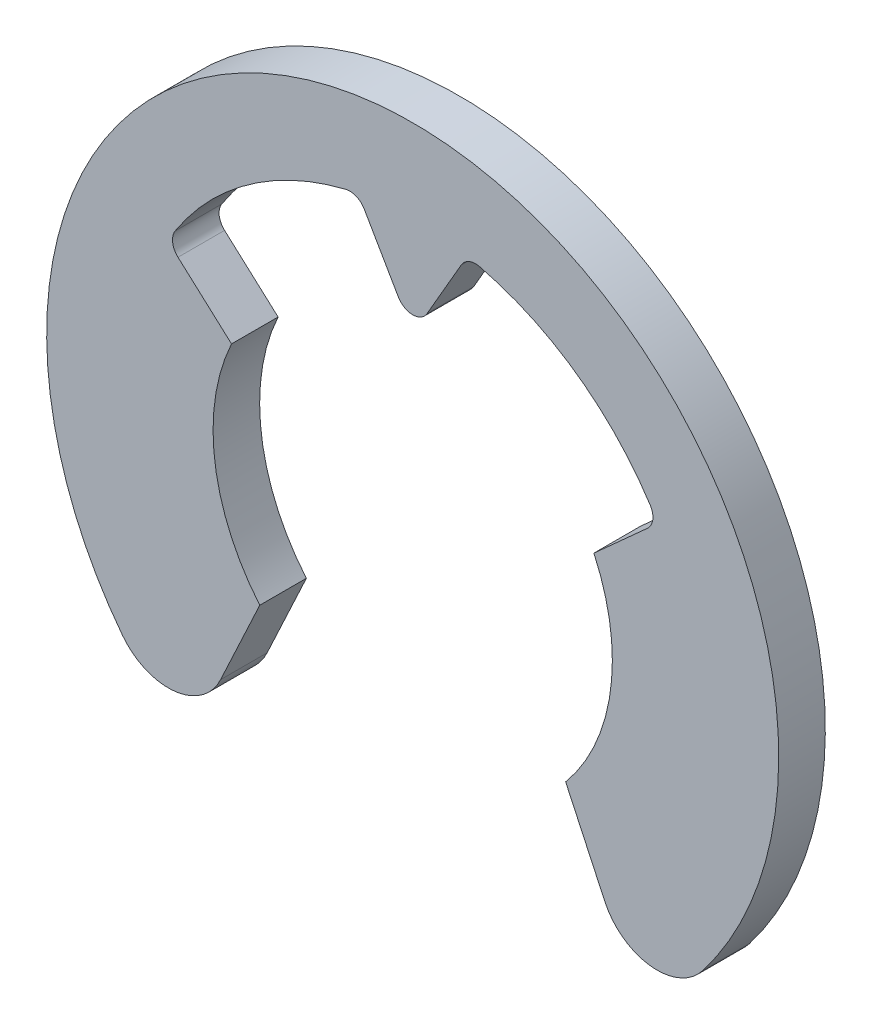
ISO-10303-21;
HEADER;
FILE_DESCRIPTION(('STEP AP214'),'2;1');
FILE_NAME('part.step','',(''),(''),'','','');
FILE_SCHEMA(('AUTOMOTIVE_DESIGN { 1 0 10303 214 1 1 1 1 }'));
ENDSEC;
DATA;
#1=APPLICATION_CONTEXT('core data for automotive mechanical design processes');
#2=APPLICATION_PROTOCOL_DEFINITION('international standard','automotive_design',2000,#1);
#3=PRODUCT_CONTEXT('',#1,'mechanical');
#4=PRODUCT('Part','Part','',(#3));
#5=PRODUCT_RELATED_PRODUCT_CATEGORY('part','',(#4));
#6=PRODUCT_DEFINITION_FORMATION('','',#4);
#7=PRODUCT_DEFINITION_CONTEXT('part definition',#1,'design');
#8=PRODUCT_DEFINITION('design','',#6,#7);
#9=PRODUCT_DEFINITION_SHAPE('','',#8);
#10=(LENGTH_UNIT() NAMED_UNIT(*) SI_UNIT(.MILLI.,.METRE.));
#11=(NAMED_UNIT(*) PLANE_ANGLE_UNIT() SI_UNIT($,.RADIAN.));
#12=(NAMED_UNIT(*) SI_UNIT($,.STERADIAN.) SOLID_ANGLE_UNIT());
#13=UNCERTAINTY_MEASURE_WITH_UNIT(LENGTH_MEASURE(1.E-05),#10,'distance_accuracy_value','');
#14=(GEOMETRIC_REPRESENTATION_CONTEXT(3) GLOBAL_UNCERTAINTY_ASSIGNED_CONTEXT((#13)) GLOBAL_UNIT_ASSIGNED_CONTEXT((#10,
#11,#12)) REPRESENTATION_CONTEXT('',''));
#15=CARTESIAN_POINT('',(0.,0.,0.));
#16=DIRECTION('',(0.,0.,1.));
#17=DIRECTION('',(1.,0.,0.));
#18=AXIS2_PLACEMENT_3D('',#15,#16,#17);
#19=CARTESIAN_POINT('',(0.94499048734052,3.88677153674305,0.));
#20=DIRECTION('',(0.,0.,1.));
#21=DIRECTION('',(1.,0.,0.));
#22=AXIS2_PLACEMENT_3D('',#19,#20,#21);
#23=PLANE('',#22);
#24=DIRECTION('',(0.500000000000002,0.866025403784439,0.));
#25=VECTOR('',#24,1.);
#26=CARTESIAN_POINT('',(0.21650635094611,3.125,0.));
#27=LINE('',#26,#25);
#28=CARTESIAN_POINT('',(0.21650635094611,3.125,0.));
#29=VERTEX_POINT('',#28);
#30=CARTESIAN_POINT('',(0.72848413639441,4.01177153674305,0.));
#31=VERTEX_POINT('',#30);
#32=EDGE_CURVE('E268',#29,#31,#27,.T.);
#33=ORIENTED_EDGE('',*,*,#32,.F.);
#34=CARTESIAN_POINT('',(0.,3.25,0.));
#35=DIRECTION('',(0.,0.,-1.));
#36=DIRECTION('',(-1.,0.,0.));
#37=AXIS2_PLACEMENT_3D('',#34,#35,#36);
#38=CIRCLE('',#37,0.250000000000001);
#39=CARTESIAN_POINT('',(-0.21650635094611,3.125,0.));
#40=VERTEX_POINT('',#39);
#41=EDGE_CURVE('E269',#40,#29,#38,.F.);
#42=ORIENTED_EDGE('',*,*,#41,.F.);
#43=DIRECTION('',(0.500000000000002,-0.866025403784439,0.));
#44=VECTOR('',#43,1.);
#45=CARTESIAN_POINT('',(-0.72848413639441,4.01177153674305,0.));
#46=LINE('',#45,#44);
#47=CARTESIAN_POINT('',(-0.72848413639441,4.01177153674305,0.));
#48=VERTEX_POINT('',#47);
#49=EDGE_CURVE('E145',#48,#40,#46,.T.);
#50=ORIENTED_EDGE('',*,*,#49,.F.);
#51=CARTESIAN_POINT('',(-0.94499048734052,3.88677153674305,0.));
#52=DIRECTION('',(0.,0.,-1.));
#53=DIRECTION('',(-1.,0.,0.));
#54=AXIS2_PLACEMENT_3D('',#51,#52,#53);
#55=CIRCLE('',#54,0.25);
#56=CARTESIAN_POINT('',(-1.0040523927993,4.12969475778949,0.));
#57=VERTEX_POINT('',#56);
#58=EDGE_CURVE('E20',#57,#48,#55,.T.);
#59=ORIENTED_EDGE('',*,*,#58,.F.);
#60=CARTESIAN_POINT('',(0.,0.,0.));
#61=DIRECTION('',(0.,0.,-1.));
#62=DIRECTION('',(-1.,0.,0.));
#63=AXIS2_PLACEMENT_3D('',#60,#61,#62);
#64=CIRCLE('',#63,4.25);
#65=CARTESIAN_POINT('',(-3.56964438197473,2.30654264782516,0.));
#66=VERTEX_POINT('',#65);
#67=EDGE_CURVE('E142',#57,#66,#64,.F.);
#68=ORIENTED_EDGE('',*,*,#67,.T.);
#69=CARTESIAN_POINT('',(-3.35966530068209,2.17086366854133,0.));
#70=DIRECTION('',(0.,0.,-1.));
#71=DIRECTION('',(-1.,0.,0.));
#72=AXIS2_PLACEMENT_3D('',#69,#70,#71);
#73=CIRCLE('',#72,0.25);
#74=CARTESIAN_POINT('',(-3.52705789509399,1.98517651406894,0.));
#75=VERTEX_POINT('',#74);
#76=EDGE_CURVE('E168',#66,#75,#73,.F.);
#77=ORIENTED_EDGE('',*,*,#76,.T.);
#78=DIRECTION('',(-0.742748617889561,0.669570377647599,0.));
#79=VECTOR('',#78,1.);
#80=CARTESIAN_POINT('',(-3.52705789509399,1.98517651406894,0.));
#81=LINE('',#80,#79);
#82=CARTESIAN_POINT('',(-2.72258807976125,1.25996593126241,0.));
#83=VERTEX_POINT('',#82);
#84=EDGE_CURVE('E174',#83,#75,#81,.T.);
#85=ORIENTED_EDGE('',*,*,#84,.F.);
#86=CARTESIAN_POINT('',(0.,0.,0.));
#87=DIRECTION('',(0.,0.,-1.));
#88=DIRECTION('',(-1.,0.,0.));
#89=AXIS2_PLACEMENT_3D('',#86,#87,#88);
#90=CIRCLE('',#89,3.);
#91=CARTESIAN_POINT('',(-2.29813332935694,-1.92836282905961,0.));
#92=VERTEX_POINT('',#91);
#93=EDGE_CURVE('E177',#83,#92,#90,.F.);
#94=ORIENTED_EDGE('',*,*,#93,.T.);
#95=DIRECTION('',(0.422618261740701,0.90630778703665,0.));
#96=VECTOR('',#95,1.);
#97=CARTESIAN_POINT('',(-2.29813332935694,-1.92836282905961,0.));
#98=LINE('',#97,#96);
#99=CARTESIAN_POINT('',(-2.88776694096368,-3.1928361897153,0.));
#100=VERTEX_POINT('',#99);
#101=EDGE_CURVE('E181',#100,#92,#98,.T.);
#102=ORIENTED_EDGE('',*,*,#101,.F.);
#103=CARTESIAN_POINT('',(-3.67227291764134,-2.82701504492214,0.));
#104=DIRECTION('',(0.,0.,-1.));
#105=DIRECTION('',(-1.,0.,0.));
#106=AXIS2_PLACEMENT_3D('',#103,#104,#105);
#107=CIRCLE('',#106,0.865606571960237);
#108=CARTESIAN_POINT('',(-4.35817574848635,-3.35504160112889,0.));
#109=VERTEX_POINT('',#108);
#110=EDGE_CURVE('E185',#109,#100,#107,.F.);
#111=ORIENTED_EDGE('',*,*,#110,.F.);
#112=CARTESIAN_POINT('',(0.,0.,0.));
#113=DIRECTION('',(0.,0.,-1.));
#114=DIRECTION('',(-1.,0.,0.));
#115=AXIS2_PLACEMENT_3D('',#112,#113,#114);
#116=CIRCLE('',#115,5.5);
#117=CARTESIAN_POINT('',(4.35817574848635,-3.35504160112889,0.));
#118=VERTEX_POINT('',#117);
#119=EDGE_CURVE('E189',#118,#109,#116,.F.);
#120=ORIENTED_EDGE('',*,*,#119,.F.);
#121=CARTESIAN_POINT('',(3.67227291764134,-2.82701504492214,0.));
#122=DIRECTION('',(0.,0.,-1.));
#123=DIRECTION('',(-1.,0.,0.));
#124=AXIS2_PLACEMENT_3D('',#121,#122,#123);
#125=CIRCLE('',#124,0.865606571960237);
#126=CARTESIAN_POINT('',(2.88776694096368,-3.1928361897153,0.));
#127=VERTEX_POINT('',#126);
#128=EDGE_CURVE('E193',#127,#118,#125,.F.);
#129=ORIENTED_EDGE('',*,*,#128,.F.);
#130=DIRECTION('',(-0.422618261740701,0.90630778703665,0.));
#131=VECTOR('',#130,1.);
#132=CARTESIAN_POINT('',(2.29813332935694,-1.92836282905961,0.));
#133=LINE('',#132,#131);
#134=CARTESIAN_POINT('',(2.29813332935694,-1.92836282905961,0.));
#135=VERTEX_POINT('',#134);
#136=EDGE_CURVE('E196',#127,#135,#133,.T.);
#137=ORIENTED_EDGE('',*,*,#136,.T.);
#138=CARTESIAN_POINT('',(0.,0.,0.));
#139=DIRECTION('',(0.,0.,-1.));
#140=DIRECTION('',(-1.,0.,0.));
#141=AXIS2_PLACEMENT_3D('',#138,#139,#140);
#142=CIRCLE('',#141,3.);
#143=CARTESIAN_POINT('',(2.72258807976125,1.25996593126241,0.));
#144=VERTEX_POINT('',#143);
#145=EDGE_CURVE('E197',#135,#144,#142,.F.);
#146=ORIENTED_EDGE('',*,*,#145,.T.);
#147=DIRECTION('',(0.742748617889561,0.669570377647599,0.));
#148=VECTOR('',#147,1.);
#149=CARTESIAN_POINT('',(3.52705789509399,1.98517651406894,0.));
#150=LINE('',#149,#148);
#151=CARTESIAN_POINT('',(3.52705789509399,1.98517651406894,0.));
#152=VERTEX_POINT('',#151);
#153=EDGE_CURVE('E200',#144,#152,#150,.T.);
#154=ORIENTED_EDGE('',*,*,#153,.T.);
#155=CARTESIAN_POINT('',(3.35966530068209,2.17086366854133,0.));
#156=DIRECTION('',(0.,0.,-1.));
#157=DIRECTION('',(-1.,0.,0.));
#158=AXIS2_PLACEMENT_3D('',#155,#156,#157);
#159=CIRCLE('',#158,0.25);
#160=CARTESIAN_POINT('',(3.56964438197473,2.30654264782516,0.));
#161=VERTEX_POINT('',#160);
#162=EDGE_CURVE('E203',#152,#161,#159,.F.);
#163=ORIENTED_EDGE('',*,*,#162,.T.);
#164=CARTESIAN_POINT('',(0.,0.,0.));
#165=DIRECTION('',(0.,0.,-1.));
#166=DIRECTION('',(-1.,0.,0.));
#167=AXIS2_PLACEMENT_3D('',#164,#165,#166);
#168=CIRCLE('',#167,4.25);
#169=CARTESIAN_POINT('',(1.0040523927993,4.12969475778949,0.));
#170=VERTEX_POINT('',#169);
#171=EDGE_CURVE('E206',#161,#170,#168,.F.);
#172=ORIENTED_EDGE('',*,*,#171,.T.);
#173=CARTESIAN_POINT('',(0.94499048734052,3.88677153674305,0.));
#174=DIRECTION('',(0.,0.,-1.));
#175=DIRECTION('',(-1.,0.,0.));
#176=AXIS2_PLACEMENT_3D('',#173,#174,#175);
#177=CIRCLE('',#176,0.25);
#178=EDGE_CURVE('E209',#170,#31,#177,.F.);
#179=ORIENTED_EDGE('',*,*,#178,.T.);
#180=EDGE_LOOP('',(#33,#42,#50,#59,#68,#77,#85,#94,#102,#111,#120,#129,#137,#146,#154,#163,#172,#179));
#181=FACE_BOUND('',#180,.T.);
#182=ADVANCED_FACE('F16',(#181),#23,.F.);
#183=CARTESIAN_POINT('',(0.94499048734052,3.88677153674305,0.700000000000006));
#184=DIRECTION('',(0.,0.,-1.));
#185=DIRECTION('',(-1.,0.,0.));
#186=AXIS2_PLACEMENT_3D('',#183,#184,#185);
#187=CYLINDRICAL_SURFACE('',#186,0.25);
#188=DIRECTION('',(0.,0.,-1.));
#189=VECTOR('',#188,1.);
#190=CARTESIAN_POINT('',(1.0040523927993,4.12969475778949,0.700000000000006));
#191=LINE('',#190,#189);
#192=CARTESIAN_POINT('',(1.0040523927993,4.12969475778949,0.700000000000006));
#193=VERTEX_POINT('',#192);
#194=EDGE_CURVE('E207',#170,#193,#191,.F.);
#195=ORIENTED_EDGE('',*,*,#194,.T.);
#196=CARTESIAN_POINT('',(0.94499048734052,3.88677153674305,0.700000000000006));
#197=DIRECTION('',(0.,0.,-1.));
#198=DIRECTION('',(-1.,0.,0.));
#199=AXIS2_PLACEMENT_3D('',#196,#197,#198);
#200=CIRCLE('',#199,0.25);
#201=CARTESIAN_POINT('',(0.72848413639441,4.01177153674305,0.700000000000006));
#202=VERTEX_POINT('',#201);
#203=EDGE_CURVE('E249',#202,#193,#200,.T.);
#204=ORIENTED_EDGE('',*,*,#203,.F.);
#205=DIRECTION('',(0.,0.,1.));
#206=VECTOR('',#205,1.);
#207=CARTESIAN_POINT('',(0.72848413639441,4.01177153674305,0.700000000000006));
#208=LINE('',#207,#206);
#209=EDGE_CURVE('E251',#202,#31,#208,.F.);
#210=ORIENTED_EDGE('',*,*,#209,.T.);
#211=ORIENTED_EDGE('',*,*,#178,.F.);
#212=EDGE_LOOP('',(#195,#204,#210,#211));
#213=FACE_BOUND('',#212,.T.);
#214=ADVANCED_FACE('F426',(#213),#187,.F.);
#215=CARTESIAN_POINT('',(0.,0.,0.700000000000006));
#216=DIRECTION('',(0.,0.,-1.));
#217=DIRECTION('',(-1.,0.,0.));
#218=AXIS2_PLACEMENT_3D('',#215,#216,#217);
#219=CYLINDRICAL_SURFACE('',#218,4.25);
#220=DIRECTION('',(0.,0.,-1.));
#221=VECTOR('',#220,1.);
#222=CARTESIAN_POINT('',(3.56964438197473,2.30654264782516,0.700000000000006));
#223=LINE('',#222,#221);
#224=CARTESIAN_POINT('',(3.56964438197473,2.30654264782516,0.700000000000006));
#225=VERTEX_POINT('',#224);
#226=EDGE_CURVE('E204',#161,#225,#223,.F.);
#227=ORIENTED_EDGE('',*,*,#226,.T.);
#228=CARTESIAN_POINT('',(0.,0.,0.700000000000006));
#229=DIRECTION('',(0.,0.,-1.));
#230=DIRECTION('',(-1.,0.,0.));
#231=AXIS2_PLACEMENT_3D('',#228,#229,#230);
#232=CIRCLE('',#231,4.25);
#233=EDGE_CURVE('E246',#193,#225,#232,.T.);
#234=ORIENTED_EDGE('',*,*,#233,.F.);
#235=ORIENTED_EDGE('',*,*,#194,.F.);
#236=ORIENTED_EDGE('',*,*,#171,.F.);
#237=EDGE_LOOP('',(#227,#234,#235,#236));
#238=FACE_BOUND('',#237,.T.);
#239=ADVANCED_FACE('F418',(#238),#219,.F.);
#240=CARTESIAN_POINT('',(3.35966530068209,2.17086366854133,0.700000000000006));
#241=DIRECTION('',(0.,0.,-1.));
#242=DIRECTION('',(-1.,0.,0.));
#243=AXIS2_PLACEMENT_3D('',#240,#241,#242);
#244=CYLINDRICAL_SURFACE('',#243,0.25);
#245=DIRECTION('',(0.,0.,1.));
#246=VECTOR('',#245,1.);
#247=CARTESIAN_POINT('',(3.52705789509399,1.98517651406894,0.700000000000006));
#248=LINE('',#247,#246);
#249=CARTESIAN_POINT('',(3.52705789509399,1.98517651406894,0.700000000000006));
#250=VERTEX_POINT('',#249);
#251=EDGE_CURVE('E201',#152,#250,#248,.T.);
#252=ORIENTED_EDGE('',*,*,#251,.T.);
#253=CARTESIAN_POINT('',(3.35966530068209,2.17086366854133,0.700000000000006));
#254=DIRECTION('',(0.,0.,-1.));
#255=DIRECTION('',(-1.,0.,0.));
#256=AXIS2_PLACEMENT_3D('',#253,#254,#255);
#257=CIRCLE('',#256,0.25);
#258=EDGE_CURVE('E243',#225,#250,#257,.T.);
#259=ORIENTED_EDGE('',*,*,#258,.F.);
#260=ORIENTED_EDGE('',*,*,#226,.F.);
#261=ORIENTED_EDGE('',*,*,#162,.F.);
#262=EDGE_LOOP('',(#252,#259,#260,#261));
#263=FACE_BOUND('',#262,.T.);
#264=ADVANCED_FACE('F410',(#263),#244,.F.);
#265=CARTESIAN_POINT('',(3.52705789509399,1.98517651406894,0.700000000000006));
#266=DIRECTION('',(0.669570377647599,-0.742748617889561,0.));
#267=DIRECTION('',(0.742748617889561,0.669570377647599,0.));
#268=AXIS2_PLACEMENT_3D('',#265,#266,#267);
#269=PLANE('',#268);
#270=DIRECTION('',(0.,0.,-1.));
#271=VECTOR('',#270,1.);
#272=CARTESIAN_POINT('',(2.72258807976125,1.25996593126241,0.700000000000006));
#273=LINE('',#272,#271);
#274=CARTESIAN_POINT('',(2.72258807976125,1.25996593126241,0.700000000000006));
#275=VERTEX_POINT('',#274);
#276=EDGE_CURVE('E198',#144,#275,#273,.F.);
#277=ORIENTED_EDGE('',*,*,#276,.T.);
#278=DIRECTION('',(-0.742748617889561,-0.669570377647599,0.));
#279=VECTOR('',#278,1.);
#280=CARTESIAN_POINT('',(3.52705789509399,1.98517651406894,0.700000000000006));
#281=LINE('',#280,#279);
#282=EDGE_CURVE('E242',#250,#275,#281,.T.);
#283=ORIENTED_EDGE('',*,*,#282,.F.);
#284=ORIENTED_EDGE('',*,*,#251,.F.);
#285=ORIENTED_EDGE('',*,*,#153,.F.);
#286=EDGE_LOOP('',(#277,#283,#284,#285));
#287=FACE_BOUND('',#286,.T.);
#288=ADVANCED_FACE('F402',(#287),#269,.F.);
#289=CARTESIAN_POINT('',(0.,0.,0.700000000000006));
#290=DIRECTION('',(0.,0.,-1.));
#291=DIRECTION('',(-1.,0.,0.));
#292=AXIS2_PLACEMENT_3D('',#289,#290,#291);
#293=CYLINDRICAL_SURFACE('',#292,3.);
#294=DIRECTION('',(0.,0.,1.));
#295=VECTOR('',#294,1.);
#296=CARTESIAN_POINT('',(2.29813332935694,-1.92836282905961,0.700000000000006));
#297=LINE('',#296,#295);
#298=CARTESIAN_POINT('',(2.29813332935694,-1.92836282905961,0.700000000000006));
#299=VERTEX_POINT('',#298);
#300=EDGE_CURVE('E194',#135,#299,#297,.T.);
#301=ORIENTED_EDGE('',*,*,#300,.T.);
#302=CARTESIAN_POINT('',(0.,0.,0.700000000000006));
#303=DIRECTION('',(0.,0.,-1.));
#304=DIRECTION('',(-1.,0.,0.));
#305=AXIS2_PLACEMENT_3D('',#302,#303,#304);
#306=CIRCLE('',#305,3.);
#307=EDGE_CURVE('E239',#275,#299,#306,.T.);
#308=ORIENTED_EDGE('',*,*,#307,.F.);
#309=ORIENTED_EDGE('',*,*,#276,.F.);
#310=ORIENTED_EDGE('',*,*,#145,.F.);
#311=EDGE_LOOP('',(#301,#308,#309,#310));
#312=FACE_BOUND('',#311,.T.);
#313=ADVANCED_FACE('F394',(#312),#293,.F.);
#314=CARTESIAN_POINT('',(2.29813332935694,-1.92836282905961,0.700000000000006));
#315=DIRECTION('',(0.90630778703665,0.422618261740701,0.));
#316=DIRECTION('',(-0.422618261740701,0.90630778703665,0.));
#317=AXIS2_PLACEMENT_3D('',#314,#315,#316);
#318=PLANE('',#317);
#319=DIRECTION('',(0.,0.,-1.));
#320=VECTOR('',#319,1.);
#321=CARTESIAN_POINT('',(2.88776694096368,-3.1928361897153,0.700000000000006));
#322=LINE('',#321,#320);
#323=CARTESIAN_POINT('',(2.88776694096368,-3.1928361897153,0.700000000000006));
#324=VERTEX_POINT('',#323);
#325=EDGE_CURVE('E190',#324,#127,#322,.T.);
#326=ORIENTED_EDGE('',*,*,#325,.F.);
#327=DIRECTION('',(0.422618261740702,-0.90630778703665,0.));
#328=VECTOR('',#327,1.);
#329=CARTESIAN_POINT('',(2.29813332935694,-1.92836282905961,0.700000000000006));
#330=LINE('',#329,#328);
#331=EDGE_CURVE('E238',#299,#324,#330,.T.);
#332=ORIENTED_EDGE('',*,*,#331,.F.);
#333=ORIENTED_EDGE('',*,*,#300,.F.);
#334=ORIENTED_EDGE('',*,*,#136,.F.);
#335=EDGE_LOOP('',(#326,#332,#333,#334));
#336=FACE_BOUND('',#335,.T.);
#337=ADVANCED_FACE('F386',(#336),#318,.F.);
#338=CARTESIAN_POINT('',(3.67227291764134,-2.82701504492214,0.700000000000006));
#339=DIRECTION('',(0.,0.,-1.));
#340=DIRECTION('',(-1.,0.,0.));
#341=AXIS2_PLACEMENT_3D('',#338,#339,#340);
#342=CYLINDRICAL_SURFACE('',#341,0.865606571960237);
#343=CARTESIAN_POINT('',(3.67227291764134,-2.82701504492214,0.700000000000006));
#344=DIRECTION('',(0.,0.,-1.));
#345=DIRECTION('',(-1.,0.,0.));
#346=AXIS2_PLACEMENT_3D('',#343,#344,#345);
#347=CIRCLE('',#346,0.865606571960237);
#348=CARTESIAN_POINT('',(4.35817574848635,-3.35504160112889,0.700000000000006));
#349=VERTEX_POINT('',#348);
#350=EDGE_CURVE('E235',#324,#349,#347,.F.);
#351=ORIENTED_EDGE('',*,*,#350,.F.);
#352=ORIENTED_EDGE('',*,*,#325,.T.);
#353=ORIENTED_EDGE('',*,*,#128,.T.);
#354=DIRECTION('',(0.,0.,-1.));
#355=VECTOR('',#354,1.);
#356=CARTESIAN_POINT('',(4.35817574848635,-3.35504160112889,0.700000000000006));
#357=LINE('',#356,#355);
#358=EDGE_CURVE('E186',#349,#118,#357,.T.);
#359=ORIENTED_EDGE('',*,*,#358,.F.);
#360=EDGE_LOOP('',(#351,#352,#353,#359));
#361=FACE_BOUND('',#360,.T.);
#362=ADVANCED_FACE('F378',(#361),#342,.T.);
#363=CARTESIAN_POINT('',(0.,0.,0.700000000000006));
#364=DIRECTION('',(0.,0.,-1.));
#365=DIRECTION('',(-1.,0.,0.));
#366=AXIS2_PLACEMENT_3D('',#363,#364,#365);
#367=CYLINDRICAL_SURFACE('',#366,5.5);
#368=ORIENTED_EDGE('',*,*,#119,.T.);
#369=DIRECTION('',(0.,0.,-1.));
#370=VECTOR('',#369,1.);
#371=CARTESIAN_POINT('',(-4.35817574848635,-3.35504160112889,0.700000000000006));
#372=LINE('',#371,#370);
#373=CARTESIAN_POINT('',(-4.35817574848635,-3.35504160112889,0.700000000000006));
#374=VERTEX_POINT('',#373);
#375=EDGE_CURVE('E182',#374,#109,#372,.T.);
#376=ORIENTED_EDGE('',*,*,#375,.F.);
#377=CARTESIAN_POINT('',(0.,0.,0.700000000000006));
#378=DIRECTION('',(0.,0.,-1.));
#379=DIRECTION('',(-1.,0.,0.));
#380=AXIS2_PLACEMENT_3D('',#377,#378,#379);
#381=CIRCLE('',#380,5.5);
#382=EDGE_CURVE('E233',#349,#374,#381,.F.);
#383=ORIENTED_EDGE('',*,*,#382,.F.);
#384=ORIENTED_EDGE('',*,*,#358,.T.);
#385=EDGE_LOOP('',(#368,#376,#383,#384));
#386=FACE_BOUND('',#385,.T.);
#387=ADVANCED_FACE('F370',(#386),#367,.T.);
#388=CARTESIAN_POINT('',(-3.67227291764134,-2.82701504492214,0.700000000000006));
#389=DIRECTION('',(0.,0.,-1.));
#390=DIRECTION('',(-1.,0.,0.));
#391=AXIS2_PLACEMENT_3D('',#388,#389,#390);
#392=CYLINDRICAL_SURFACE('',#391,0.865606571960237);
#393=CARTESIAN_POINT('',(-3.67227291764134,-2.82701504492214,0.700000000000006));
#394=DIRECTION('',(0.,0.,-1.));
#395=DIRECTION('',(-1.,0.,0.));
#396=AXIS2_PLACEMENT_3D('',#393,#394,#395);
#397=CIRCLE('',#396,0.865606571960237);
#398=CARTESIAN_POINT('',(-2.88776694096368,-3.1928361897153,0.700000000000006));
#399=VERTEX_POINT('',#398);
#400=EDGE_CURVE('E230',#374,#399,#397,.F.);
#401=ORIENTED_EDGE('',*,*,#400,.F.);
#402=ORIENTED_EDGE('',*,*,#375,.T.);
#403=ORIENTED_EDGE('',*,*,#110,.T.);
#404=DIRECTION('',(0.,0.,1.));
#405=VECTOR('',#404,1.);
#406=CARTESIAN_POINT('',(-2.88776694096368,-3.1928361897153,0.700000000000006));
#407=LINE('',#406,#405);
#408=EDGE_CURVE('E178',#399,#100,#407,.F.);
#409=ORIENTED_EDGE('',*,*,#408,.F.);
#410=EDGE_LOOP('',(#401,#402,#403,#409));
#411=FACE_BOUND('',#410,.T.);
#412=ADVANCED_FACE('F362',(#411),#392,.T.);
#413=CARTESIAN_POINT('',(-2.29813332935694,-1.92836282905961,0.700000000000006));
#414=DIRECTION('',(0.90630778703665,-0.422618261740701,0.));
#415=DIRECTION('',(0.422618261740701,0.90630778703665,0.));
#416=AXIS2_PLACEMENT_3D('',#413,#414,#415);
#417=PLANE('',#416);
#418=DIRECTION('',(0.422618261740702,0.90630778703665,0.));
#419=VECTOR('',#418,1.);
#420=CARTESIAN_POINT('',(-2.88776694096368,-3.1928361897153,0.700000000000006));
#421=LINE('',#420,#419);
#422=CARTESIAN_POINT('',(-2.29813332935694,-1.92836282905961,0.700000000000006));
#423=VERTEX_POINT('',#422);
#424=EDGE_CURVE('E229',#399,#423,#421,.T.);
#425=ORIENTED_EDGE('',*,*,#424,.F.);
#426=ORIENTED_EDGE('',*,*,#408,.T.);
#427=ORIENTED_EDGE('',*,*,#101,.T.);
#428=DIRECTION('',(0.,0.,-1.));
#429=VECTOR('',#428,1.);
#430=CARTESIAN_POINT('',(-2.29813332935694,-1.92836282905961,0.700000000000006));
#431=LINE('',#430,#429);
#432=EDGE_CURVE('E175',#92,#423,#431,.F.);
#433=ORIENTED_EDGE('',*,*,#432,.T.);
#434=EDGE_LOOP('',(#425,#426,#427,#433));
#435=FACE_BOUND('',#434,.T.);
#436=ADVANCED_FACE('F354',(#435),#417,.T.);
#437=CARTESIAN_POINT('',(0.,0.,0.700000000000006));
#438=DIRECTION('',(0.,0.,-1.));
#439=DIRECTION('',(-1.,0.,0.));
#440=AXIS2_PLACEMENT_3D('',#437,#438,#439);
#441=CYLINDRICAL_SURFACE('',#440,3.);
#442=DIRECTION('',(0.,0.,1.));
#443=VECTOR('',#442,1.);
#444=CARTESIAN_POINT('',(-2.72258807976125,1.25996593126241,0.700000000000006));
#445=LINE('',#444,#443);
#446=CARTESIAN_POINT('',(-2.72258807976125,1.25996593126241,0.700000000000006));
#447=VERTEX_POINT('',#446);
#448=EDGE_CURVE('E171',#447,#83,#445,.F.);
#449=ORIENTED_EDGE('',*,*,#448,.F.);
#450=CARTESIAN_POINT('',(0.,0.,0.700000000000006));
#451=DIRECTION('',(0.,0.,-1.));
#452=DIRECTION('',(-1.,0.,0.));
#453=AXIS2_PLACEMENT_3D('',#450,#451,#452);
#454=CIRCLE('',#453,3.);
#455=EDGE_CURVE('E227',#423,#447,#454,.T.);
#456=ORIENTED_EDGE('',*,*,#455,.F.);
#457=ORIENTED_EDGE('',*,*,#432,.F.);
#458=ORIENTED_EDGE('',*,*,#93,.F.);
#459=EDGE_LOOP('',(#449,#456,#457,#458));
#460=FACE_BOUND('',#459,.T.);
#461=ADVANCED_FACE('F346',(#460),#441,.F.);
#462=CARTESIAN_POINT('',(-3.52705789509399,1.98517651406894,0.700000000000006));
#463=DIRECTION('',(0.669570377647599,0.742748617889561,0.));
#464=DIRECTION('',(-0.742748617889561,0.669570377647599,0.));
#465=AXIS2_PLACEMENT_3D('',#462,#463,#464);
#466=PLANE('',#465);
#467=DIRECTION('',(-0.742748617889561,0.669570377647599,0.));
#468=VECTOR('',#467,1.);
#469=CARTESIAN_POINT('',(-2.72258807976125,1.25996593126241,0.700000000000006));
#470=LINE('',#469,#468);
#471=CARTESIAN_POINT('',(-3.52705789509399,1.98517651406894,0.700000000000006));
#472=VERTEX_POINT('',#471);
#473=EDGE_CURVE('E226',#447,#472,#470,.T.);
#474=ORIENTED_EDGE('',*,*,#473,.F.);
#475=ORIENTED_EDGE('',*,*,#448,.T.);
#476=ORIENTED_EDGE('',*,*,#84,.T.);
#477=DIRECTION('',(0.,0.,-1.));
#478=VECTOR('',#477,1.);
#479=CARTESIAN_POINT('',(-3.52705789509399,1.98517651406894,0.700000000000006));
#480=LINE('',#479,#478);
#481=EDGE_CURVE('E169',#75,#472,#480,.F.);
#482=ORIENTED_EDGE('',*,*,#481,.T.);
#483=EDGE_LOOP('',(#474,#475,#476,#482));
#484=FACE_BOUND('',#483,.T.);
#485=ADVANCED_FACE('F338',(#484),#466,.T.);
#486=CARTESIAN_POINT('',(-3.35966530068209,2.17086366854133,0.700000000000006));
#487=DIRECTION('',(0.,0.,-1.));
#488=DIRECTION('',(-1.,0.,0.));
#489=AXIS2_PLACEMENT_3D('',#486,#487,#488);
#490=CYLINDRICAL_SURFACE('',#489,0.25);
#491=DIRECTION('',(0.,0.,-1.));
#492=VECTOR('',#491,1.);
#493=CARTESIAN_POINT('',(-3.56964438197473,2.30654264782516,0.700000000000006));
#494=LINE('',#493,#492);
#495=CARTESIAN_POINT('',(-3.56964438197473,2.30654264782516,0.700000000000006));
#496=VERTEX_POINT('',#495);
#497=EDGE_CURVE('E155',#66,#496,#494,.F.);
#498=ORIENTED_EDGE('',*,*,#497,.T.);
#499=CARTESIAN_POINT('',(-3.35966530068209,2.17086366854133,0.700000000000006));
#500=DIRECTION('',(0.,0.,-1.));
#501=DIRECTION('',(-1.,0.,0.));
#502=AXIS2_PLACEMENT_3D('',#499,#500,#501);
#503=CIRCLE('',#502,0.25);
#504=EDGE_CURVE('E224',#472,#496,#503,.T.);
#505=ORIENTED_EDGE('',*,*,#504,.F.);
#506=ORIENTED_EDGE('',*,*,#481,.F.);
#507=ORIENTED_EDGE('',*,*,#76,.F.);
#508=EDGE_LOOP('',(#498,#505,#506,#507));
#509=FACE_BOUND('',#508,.T.);
#510=ADVANCED_FACE('F331',(#509),#490,.F.);
#511=CARTESIAN_POINT('',(0.,0.,0.700000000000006));
#512=DIRECTION('',(0.,0.,-1.));
#513=DIRECTION('',(-1.,0.,0.));
#514=AXIS2_PLACEMENT_3D('',#511,#512,#513);
#515=CYLINDRICAL_SURFACE('',#514,4.25);
#516=DIRECTION('',(0.,0.,-1.));
#517=VECTOR('',#516,1.);
#518=CARTESIAN_POINT('',(-1.0040523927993,4.12969475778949,0.700000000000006));
#519=LINE('',#518,#517);
#520=CARTESIAN_POINT('',(-1.0040523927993,4.12969475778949,0.700000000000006));
#521=VERTEX_POINT('',#520);
#522=EDGE_CURVE('E152',#57,#521,#519,.F.);
#523=ORIENTED_EDGE('',*,*,#522,.T.);
#524=CARTESIAN_POINT('',(0.,0.,0.700000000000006));
#525=DIRECTION('',(0.,0.,-1.));
#526=DIRECTION('',(-1.,0.,0.));
#527=AXIS2_PLACEMENT_3D('',#524,#525,#526);
#528=CIRCLE('',#527,4.25);
#529=EDGE_CURVE('E222',#496,#521,#528,.T.);
#530=ORIENTED_EDGE('',*,*,#529,.F.);
#531=ORIENTED_EDGE('',*,*,#497,.F.);
#532=ORIENTED_EDGE('',*,*,#67,.F.);
#533=EDGE_LOOP('',(#523,#530,#531,#532));
#534=FACE_BOUND('',#533,.T.);
#535=ADVANCED_FACE('F150',(#534),#515,.F.);
#536=CARTESIAN_POINT('',(-0.94499048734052,3.88677153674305,0.700000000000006));
#537=DIRECTION('',(0.,0.,-1.));
#538=DIRECTION('',(-1.,0.,0.));
#539=AXIS2_PLACEMENT_3D('',#536,#537,#538);
#540=CYLINDRICAL_SURFACE('',#539,0.25);
#541=DIRECTION('',(0.,0.,1.));
#542=VECTOR('',#541,1.);
#543=CARTESIAN_POINT('',(-0.72848413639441,4.01177153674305,0.700000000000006));
#544=LINE('',#543,#542);
#545=CARTESIAN_POINT('',(-0.72848413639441,4.01177153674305,0.700000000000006));
#546=VERTEX_POINT('',#545);
#547=EDGE_CURVE('E161',#546,#48,#544,.F.);
#548=ORIENTED_EDGE('',*,*,#547,.F.);
#549=CARTESIAN_POINT('',(-0.94499048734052,3.88677153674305,0.700000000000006));
#550=DIRECTION('',(0.,0.,-1.));
#551=DIRECTION('',(-1.,0.,0.));
#552=AXIS2_PLACEMENT_3D('',#549,#550,#551);
#553=CIRCLE('',#552,0.25);
#554=EDGE_CURVE('E159',#521,#546,#553,.T.);
#555=ORIENTED_EDGE('',*,*,#554,.F.);
#556=ORIENTED_EDGE('',*,*,#522,.F.);
#557=ORIENTED_EDGE('',*,*,#58,.T.);
#558=EDGE_LOOP('',(#548,#555,#556,#557));
#559=FACE_BOUND('',#558,.T.);
#560=ADVANCED_FACE('F157',(#559),#540,.F.);
#561=CARTESIAN_POINT('',(-0.21650635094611,3.125,0.700000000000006));
#562=DIRECTION('',(-0.866025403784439,-0.500000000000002,0.));
#563=DIRECTION('',(0.500000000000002,-0.866025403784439,0.));
#564=AXIS2_PLACEMENT_3D('',#561,#562,#563);
#565=PLANE('',#564);
#566=DIRECTION('',(0.500000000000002,-0.866025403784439,0.));
#567=VECTOR('',#566,1.);
#568=CARTESIAN_POINT('',(-0.72848413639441,4.01177153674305,0.700000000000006));
#569=LINE('',#568,#567);
#570=CARTESIAN_POINT('',(-0.21650635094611,3.125,0.700000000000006));
#571=VERTEX_POINT('',#570);
#572=EDGE_CURVE('E220',#546,#571,#569,.T.);
#573=ORIENTED_EDGE('',*,*,#572,.F.);
#574=ORIENTED_EDGE('',*,*,#547,.T.);
#575=ORIENTED_EDGE('',*,*,#49,.T.);
#576=DIRECTION('',(0.,0.,-1.));
#577=VECTOR('',#576,1.);
#578=CARTESIAN_POINT('',(-0.21650635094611,3.125,0.700000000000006));
#579=LINE('',#578,#577);
#580=EDGE_CURVE('E163',#571,#40,#579,.T.);
#581=ORIENTED_EDGE('',*,*,#580,.F.);
#582=EDGE_LOOP('',(#573,#574,#575,#581));
#583=FACE_BOUND('',#582,.T.);
#584=ADVANCED_FACE('F293',(#583),#565,.T.);
#585=CARTESIAN_POINT('',(0.,3.25,0.700000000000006));
#586=DIRECTION('',(0.,0.,-1.));
#587=DIRECTION('',(-1.,0.,0.));
#588=AXIS2_PLACEMENT_3D('',#585,#586,#587);
#589=CYLINDRICAL_SURFACE('',#588,0.250000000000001);
#590=CARTESIAN_POINT('',(0.,3.25,0.700000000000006));
#591=DIRECTION('',(0.,0.,-1.));
#592=DIRECTION('',(-1.,0.,0.));
#593=AXIS2_PLACEMENT_3D('',#590,#591,#592);
#594=CIRCLE('',#593,0.250000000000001);
#595=CARTESIAN_POINT('',(0.21650635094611,3.125,0.700000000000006));
#596=VERTEX_POINT('',#595);
#597=EDGE_CURVE('E26',#571,#596,#594,.F.);
#598=ORIENTED_EDGE('',*,*,#597,.F.);
#599=ORIENTED_EDGE('',*,*,#580,.T.);
#600=ORIENTED_EDGE('',*,*,#41,.T.);
#601=DIRECTION('',(0.,0.,1.));
#602=VECTOR('',#601,1.);
#603=CARTESIAN_POINT('',(0.21650635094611,3.125,0.700000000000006));
#604=LINE('',#603,#602);
#605=EDGE_CURVE('E35',#29,#596,#604,.T.);
#606=ORIENTED_EDGE('',*,*,#605,.T.);
#607=EDGE_LOOP('',(#598,#599,#600,#606));
#608=FACE_BOUND('',#607,.T.);
#609=ADVANCED_FACE('F287',(#608),#589,.T.);
#610=CARTESIAN_POINT('',(0.21650635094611,3.125,0.700000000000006));
#611=DIRECTION('',(-0.866025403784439,0.500000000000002,0.));
#612=DIRECTION('',(-0.500000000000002,-0.866025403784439,0.));
#613=AXIS2_PLACEMENT_3D('',#610,#611,#612);
#614=PLANE('',#613);
#615=ORIENTED_EDGE('',*,*,#209,.F.);
#616=DIRECTION('',(0.500000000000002,0.866025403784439,0.));
#617=VECTOR('',#616,1.);
#618=CARTESIAN_POINT('',(0.21650635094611,3.125,0.700000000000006));
#619=LINE('',#618,#617);
#620=EDGE_CURVE('E11',#596,#202,#619,.T.);
#621=ORIENTED_EDGE('',*,*,#620,.F.);
#622=ORIENTED_EDGE('',*,*,#605,.F.);
#623=ORIENTED_EDGE('',*,*,#32,.T.);
#624=EDGE_LOOP('',(#615,#621,#622,#623));
#625=FACE_BOUND('',#624,.T.);
#626=ADVANCED_FACE('F291',(#625),#614,.F.);
#627=CARTESIAN_POINT('',(0.94499048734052,3.88677153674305,0.700000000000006));
#628=DIRECTION('',(0.,0.,1.));
#629=DIRECTION('',(1.,0.,0.));
#630=AXIS2_PLACEMENT_3D('',#627,#628,#629);
#631=PLANE('',#630);
#632=ORIENTED_EDGE('',*,*,#597,.T.);
#633=ORIENTED_EDGE('',*,*,#620,.T.);
#634=ORIENTED_EDGE('',*,*,#203,.T.);
#635=ORIENTED_EDGE('',*,*,#233,.T.);
#636=ORIENTED_EDGE('',*,*,#258,.T.);
#637=ORIENTED_EDGE('',*,*,#282,.T.);
#638=ORIENTED_EDGE('',*,*,#307,.T.);
#639=ORIENTED_EDGE('',*,*,#331,.T.);
#640=ORIENTED_EDGE('',*,*,#350,.T.);
#641=ORIENTED_EDGE('',*,*,#382,.T.);
#642=ORIENTED_EDGE('',*,*,#400,.T.);
#643=ORIENTED_EDGE('',*,*,#424,.T.);
#644=ORIENTED_EDGE('',*,*,#455,.T.);
#645=ORIENTED_EDGE('',*,*,#473,.T.);
#646=ORIENTED_EDGE('',*,*,#504,.T.);
#647=ORIENTED_EDGE('',*,*,#529,.T.);
#648=ORIENTED_EDGE('',*,*,#554,.T.);
#649=ORIENTED_EDGE('',*,*,#572,.T.);
#650=EDGE_LOOP('',(#632,#633,#634,#635,#636,#637,#638,#639,#640,#641,#642,#643,#644,#645,#646,
#647,#648,#649));
#651=FACE_BOUND('',#650,.T.);
#652=ADVANCED_FACE('F18',(#651),#631,.T.);
#653=CLOSED_SHELL('',(#182,#214,#239,#264,#288,#313,#337,#362,#387,#412,#436,#461,#485,#510,
#535,#560,#584,#609,#626,#652));
#654=MANIFOLD_SOLID_BREP('B1',#653);
#655=ADVANCED_BREP_SHAPE_REPRESENTATION('',(#18,#654),#14);
#656=SHAPE_DEFINITION_REPRESENTATION(#9,#655);
ENDSEC;
END-ISO-10303-21;
